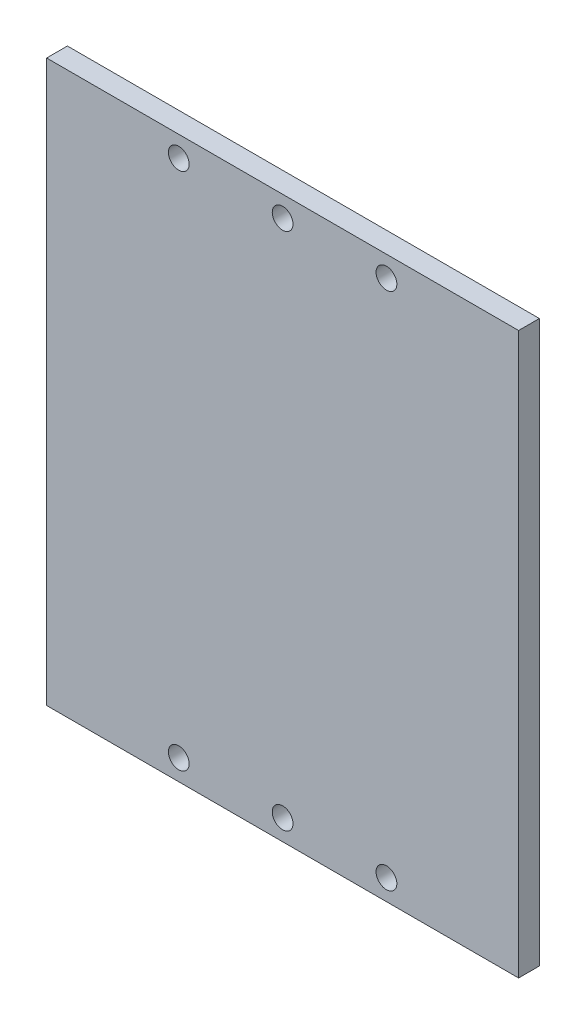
from build123d import *

# Parameters (mm, degrees)
CROQUIS1_W              = 45.45
CROQUIS1_H              = 54
CROQUIS1_R              = 1
SALIENTE_EXTRUIR2_DEPTH = 2


with BuildPart() as part:
    # Croquis1 → Saliente-Extruir2 (new body)
    with BuildSketch(Plane.XY):
        with Locations((-8.755, -22)):
            Rectangle(CROQUIS1_W, CROQUIS1_H)
        with Locations((-8.755, -47)):
            Circle(CROQUIS1_R, mode=Mode.SUBTRACT)
        with Locations((1.245, -47)):
            Circle(CROQUIS1_R, mode=Mode.SUBTRACT)
        with Locations((-18.755, -47)):
            Circle(CROQUIS1_R, mode=Mode.SUBTRACT)
        with Locations(Location((1.245, 3, 0), (0, 0, 180))):
            Circle(CROQUIS1_R, mode=Mode.SUBTRACT)
        with Locations(Location((-8.755, 3, 0), (0, 0, 180))):
            Circle(CROQUIS1_R, mode=Mode.SUBTRACT)
        with Locations(Location((-18.755, 3, 0), (0, 0, 180))):
            Circle(CROQUIS1_R, mode=Mode.SUBTRACT)
    extrude(amount=SALIENTE_EXTRUIR2_DEPTH)


solid = part.part
